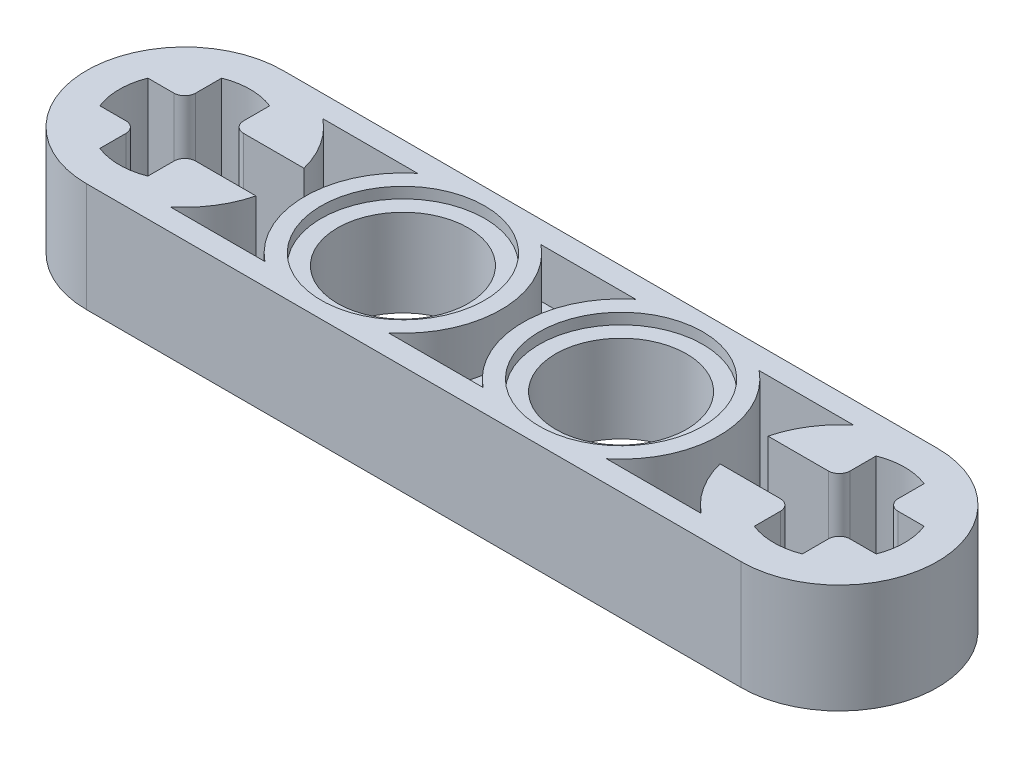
from build123d import *

# Parameters (mm, degrees)
SKETCH1_R           = 2.4
BOSS_EXTRUDE1_DEPTH = 4
CUT_EXTRUDE1_START  = -1.8
CUT_EXTRUDE1_DEPTH  = 1.8
SKETCH3_R           = 3
CUT_EXTRUDE2_DEPTH  = 0.4


with BuildPart() as part:
    # Sketch1 → Boss-Extrude1 (new body)
    with BuildSketch(Plane(origin=(0, 0, 0), x_dir=(1, 0, 0), z_dir=(0, 1, 0))):
        with BuildLine():
            Line((-12, 3.6), (12, 3.6))
            ThreePointArc((12, 3.6), (15.6, 0), (12, -3.6))
            Line((12, -3.6), (-12, -3.6))
            ThreePointArc((-12, -3.6), (-15.6, 0), (-12, 3.6))
        make_face()
        with Locations(Location((-4, 0, 0), (0, 0, 270))):
            Circle(SKETCH1_R, mode=Mode.SUBTRACT)
        with Locations(Location((4, 0, 0), (0, 0, 270))):
            Circle(SKETCH1_R, mode=Mode.SUBTRACT)
        with BuildLine():
            Line((-14.232845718, 0.88), (-13.28, 0.88))
            ThreePointArc((-13.28, 0.88), (-12.997157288, 0.997157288), (-12.88, 1.28))
            Line((-12.88, 1.28), (-12.88, 2.232845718))
            ThreePointArc((-12.88, 2.232845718), (-12, 2.4), (-11.12, 2.232845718))
            Line((-11.12, 2.232845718), (-11.12, 1.28))
            ThreePointArc((-11.12, 1.28), (-11.002842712, 0.997157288), (-10.72, 0.88))
            Line((-10.72, 0.88), (-9.767154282, 0.88))
            Line((-9.767154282, 0.88), (-8.509212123, 0.88))
            ThreePointArc((-8.509212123, 0.88), (-8.967282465, 1.939748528), (-9.7372583, 2.8))
            Line((-9.7372583, 2.8), (-6.2627417, 2.8))
            ThreePointArc((-6.2627417, 2.8), (-7.6, 0), (-6.2627417, -2.8))
            Line((-6.2627417, -2.8), (-9.7372583, -2.8))
            ThreePointArc((-9.7372583, -2.8), (-8.967282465, -1.939748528), (-8.509212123, -0.88))
            Line((-8.509212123, -0.88), (-9.767154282, -0.88))
            Line((-9.767154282, -0.88), (-10.72, -0.88))
            ThreePointArc((-10.72, -0.88), (-11.002842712, -0.997157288), (-11.12, -1.28))
            Line((-11.12, -1.28), (-11.12, -2.232845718))
            ThreePointArc((-11.12, -2.232845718), (-12, -2.4), (-12.88, -2.232845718))
            Line((-12.88, -2.232845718), (-12.88, -1.28))
            ThreePointArc((-12.88, -1.28), (-12.997157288, -0.997157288), (-13.28, -0.88))
            Line((-13.28, -0.88), (-14.232845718, -0.88))
            ThreePointArc((-14.232845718, -0.88), (-14.4, 0), (-14.232845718, 0.88))
        make_face(mode=Mode.SUBTRACT)
        with BuildLine():
            Line((11.12, 2.232845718), (11.12, 1.28))
            ThreePointArc((11.12, 1.28), (11.002842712, 0.997157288), (10.72, 0.88))
            Line((10.72, 0.88), (9.767154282, 0.88))
            Line((9.767154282, 0.88), (8.509212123, 0.88))
            ThreePointArc((8.509212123, 0.88), (8.967282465, 1.939748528), (9.7372583, 2.8))
            Line((9.7372583, 2.8), (6.2627417, 2.8))
            ThreePointArc((6.2627417, 2.8), (7.6, 0), (6.2627417, -2.8))
            Line((6.2627417, -2.8), (9.7372583, -2.8))
            ThreePointArc((9.7372583, -2.8), (8.967282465, -1.939748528), (8.509212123, -0.88))
            Line((8.509212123, -0.88), (9.767154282, -0.88))
            Line((9.767154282, -0.88), (10.72, -0.88))
            ThreePointArc((10.72, -0.88), (11.002842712, -0.997157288), (11.12, -1.28))
            Line((11.12, -1.28), (11.12, -2.232845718))
            ThreePointArc((11.12, -2.232845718), (12, -2.4), (12.88, -2.232845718))
            Line((12.88, -2.232845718), (12.88, -1.28))
            ThreePointArc((12.88, -1.28), (12.997157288, -0.997157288), (13.28, -0.88))
            Line((13.28, -0.88), (14.232845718, -0.88))
            ThreePointArc((14.232845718, -0.88), (14.4, 0), (14.232845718, 0.88))
            Line((14.232845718, 0.88), (13.28, 0.88))
            ThreePointArc((13.28, 0.88), (12.997157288, 0.997157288), (12.88, 1.28))
            Line((12.88, 1.28), (12.88, 2.232845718))
            ThreePointArc((12.88, 2.232845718), (12, 2.4), (11.12, 2.232845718))
        make_face(mode=Mode.SUBTRACT)
    extrude(amount=BOSS_EXTRUDE1_DEPTH)

    # Sketch2 → Cut-Extrude1 (cut)
    with BuildSketch(Plane(origin=(0, 4, 0), x_dir=(1, 0, 0), z_dir=(0, 1, 0)).offset(CUT_EXTRUDE1_START)):
        with BuildLine():
            Line((-1.7372583, 2.8), (1.7372583, 2.8))
            ThreePointArc((1.7372583, 2.8), (0.4, 0), (1.7372583, -2.8))
            Line((1.7372583, -2.8), (-1.7372583, -2.8))
            ThreePointArc((-1.7372583, -2.8), (-0.4, 0), (-1.7372583, 2.8))
        make_face()
    cut_extrude1 = extrude(amount=CUT_EXTRUDE1_DEPTH, mode=Mode.SUBTRACT)

    # Mirror1: Cut-Extrude1 across plane
    add(cut_extrude1.mirror(Plane(origin=(0, 2, 0), x_dir=(0, 0, 1), z_dir=(0, -1, 0))), mode=Mode.SUBTRACT)

    # Sketch3 → Cut-Extrude2 (cut)
    with BuildSketch(Plane.XZ):
        with Locations(Location((-4, 0, 0), (0, 0, 270))):
            Circle(SKETCH3_R)
        with Locations(Location((4, 0, 0), (0, 0, 270))):
            Circle(SKETCH3_R)
    cut_extrude2 = extrude(amount=-CUT_EXTRUDE2_DEPTH, mode=Mode.SUBTRACT)

    # Mirror2: Cut-Extrude2 across plane
    add(cut_extrude2.mirror(Plane(origin=(0, 2, 0), x_dir=(0, 0, 1), z_dir=(0, -1, 0))), mode=Mode.SUBTRACT)


solid = part.part
